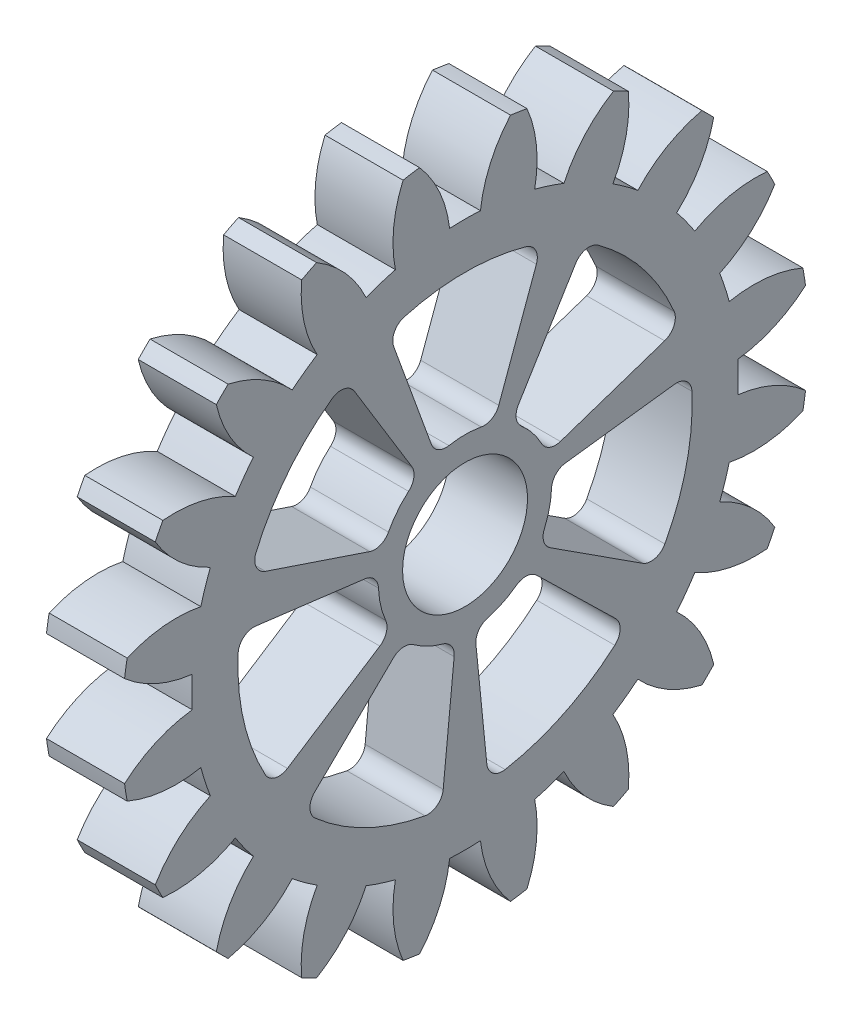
from build123d import *

# Parameters (mm, degrees)
BASPROSKE_W             = 5
BASPROSKE_H             = 22
TOOTHCUT_DEPTH          = 32.511902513
TEETHCUTS_COUNT         = 20
TEETHCUTS_ANGLE         = 342
BORSKE_R                = 4
BORE_DEPTH              = 50.0000508
ENL_V_MAT_EXTRU_1_DEPTH = 10


with BuildPart() as part:
    # BasProSke → Base-Revolve (revolve)
    with BuildSketch(Plane(origin=(0, 0, 0), x_dir=(1, 0, 0), z_dir=(0, 1, 0)), mode=Mode.PRIVATE) as base_revolve_sk:
        with Locations((2.5, 11)):
            Rectangle(BASPROSKE_W, BASPROSKE_H)
    revolve(base_revolve_sk.sketch.rotate(Axis((-10, 0, 0), (1, 0, 0)), 180), axis=Axis((-10, 0, 0), (1, 0, 0)))

    # TooCutSke → ToothCut (cut, through all)
    with BuildSketch(Plane(origin=(0, 0, 0), x_dir=(0, 0, -1), z_dir=(1, 0, 0))):
        with BuildLine():
            ThreePointArc((0.986171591, 17.471189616), (0, 17.499), (-0.986171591, 17.471189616))
            ThreePointArc((-0.986171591, 17.471189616), (-1.626916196, 19.798789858), (-2.932850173, 21.829260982))
            ThreePointArc((-2.932850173, 21.829260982), (0, 22.0254), (2.932850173, 21.829260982))
            ThreePointArc((2.932850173, 21.829260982), (1.626916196, 19.798789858), (0.986171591, 17.471189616))
        make_face()
    toothcut = extrude(amount=TOOTHCUT_DEPTH, mode=Mode.SUBTRACT)

    # TeethCuts: ToothCut ×20 about axis
    teethcuts_axis = Axis((-10, 0, 0), (1, 0, 0))
    for i in range(1, TEETHCUTS_COUNT):
        add(toothcut.rotate(teethcuts_axis, i * TEETHCUTS_ANGLE / (TEETHCUTS_COUNT - 1)), mode=Mode.SUBTRACT)

    # BorSke → Bore (cut, symmetric)
    with BuildSketch(Plane(origin=(0, 0, 0), x_dir=(0, 0, -1), z_dir=(1, 0, 0))):
        with Locations(Location((0, 0, 0), (0, 0, 180))):
            Circle(BORSKE_R)
    extrude(amount=BORE_DEPTH, both=True, mode=Mode.SUBTRACT)

    # Esquisse1 → Enl_v. mat.-Extru.1 (cut)
    with BuildSketch(Plane(origin=(5, 0, 0), x_dir=(0, 0, -1), z_dir=(1, 0, 0))):
        with BuildLine():
            Line((-4.569029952, 12.710164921), (-2.159331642, 6.089573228))
            ThreePointArc((-2.159331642, 6.089573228), (-1.714053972, 5.562367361), (-1.033326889, 5.449102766))
            ThreePointArc((-1.033326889, 5.449102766), (0, 5.546213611), (1.033326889, 5.449102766))
            ThreePointArc((1.033326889, 5.449102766), (1.714053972, 5.562367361), (2.159331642, 6.089573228))
            Line((2.159331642, 6.089573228), (4.569029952, 12.710164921))
            ThreePointArc((4.569029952, 12.710164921), (4.5185115, 13.509753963), (3.897236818, 14.015631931))
            ThreePointArc((3.897236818, 14.015631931), (0, 14.547384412), (-3.897236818, 14.015631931))
            ThreePointArc((-3.897236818, 14.015631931), (-4.5185115, 13.509753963), (-4.569029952, 12.710164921))
        make_face()
        with BuildLine():
            Line((7.088463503, 11.496869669), (3.414698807, 5.485020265))
            ThreePointArc((3.414698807, 5.485020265), (3.280138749, 4.808180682), (3.616011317, 4.205347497))
            ThreePointArc((3.616011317, 4.205347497), (4.336204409, 3.458007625), (4.904548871, 2.589572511))
            ThreePointArc((4.904548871, 2.589572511), (5.417529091, 2.127977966), (6.107341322, 2.108553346))
            Line((6.107341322, 2.108553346), (12.785950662, 4.352446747))
            ThreePointArc((12.785950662, 4.352446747), (13.379596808, 4.890479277), (13.387749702, 5.691621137))
            ThreePointArc((13.387749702, 5.691621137), (11.373603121, 9.070145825), (8.527974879, 11.785586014))
            ThreePointArc((8.527974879, 11.785586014), (7.745105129, 11.955908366), (7.088463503, 11.496869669))
        make_face()
        with BuildLine():
            Line((13.408199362, 1.626197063), (6.417391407, 0.750135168))
            ThreePointArc((6.417391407, 0.750135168), (5.804320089, 0.43333588), (5.542419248, -0.205120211))
            ThreePointArc((5.542419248, -0.205120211), (5.407158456, -1.234148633), (5.082545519, -2.219958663))
            ThreePointArc((5.082545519, -2.219958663), (5.041494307, -2.90882224), (5.45639842, -3.460250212))
            Line((5.45639842, -3.460250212), (11.374789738, -7.282752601))
            ThreePointArc((11.374789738, -7.282752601), (12.165572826, -7.411426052), (12.797014, -6.918296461))
            ThreePointArc((12.797014, -6.918296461), (14.182651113, -3.237097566), (14.531447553, 0.680753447))
            ThreePointArc((14.531447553, 0.680753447), (14.176499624, 1.399019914), (13.408199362, 1.626197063))
        make_face()
        with BuildLine():
            Line((9.631287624, -9.4690351), (4.587657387, -4.54961701))
            ThreePointArc((4.587657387, -4.54961701), (3.957730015, -4.267819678), (3.29527244, -4.461128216))
            ThreePointArc((3.29527244, -4.461128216), (2.406411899, -4.996965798), (1.433281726, -5.357815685))
            ThreePointArc((1.433281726, -5.357815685), (0.869111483, -5.75521997), (0.696676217, -6.423414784))
            Line((0.696676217, -6.423414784), (1.398180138, -13.433890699))
            ThreePointArc((1.398180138, -13.433890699), (1.790624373, -14.132376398), (2.569865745, -14.318595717))
            ThreePointArc((2.569865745, -14.318595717), (6.311873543, -13.106740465), (9.592443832, -10.936700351))
            ThreePointArc((9.592443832, -10.936700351), (9.932700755, -10.211359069), (9.631287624, -9.4690351))
        make_face()
        with BuildLine():
            Line((-1.398180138, -13.433890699), (-0.696676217, -6.423414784))
            ThreePointArc((-0.696676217, -6.423414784), (-0.869111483, -5.75521997), (-1.433281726, -5.357815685))
            ThreePointArc((-1.433281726, -5.357815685), (-2.406411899, -4.996965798), (-3.29527244, -4.461128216))
            ThreePointArc((-3.29527244, -4.461128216), (-3.957730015, -4.267819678), (-4.587657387, -4.54961701))
            Line((-4.587657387, -4.54961701), (-9.631287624, -9.4690351))
            ThreePointArc((-9.631287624, -9.4690351), (-9.932700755, -10.211359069), (-9.592443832, -10.936700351))
            ThreePointArc((-9.592443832, -10.936700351), (-6.311873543, -13.106740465), (-2.569865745, -14.318595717))
            ThreePointArc((-2.569865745, -14.318595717), (-1.790624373, -14.132376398), (-1.398180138, -13.433890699))
        make_face()
        with BuildLine():
            Line((-11.374789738, -7.282752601), (-5.45639842, -3.460250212))
            ThreePointArc((-5.45639842, -3.460250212), (-5.041494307, -2.90882224), (-5.082545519, -2.219958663))
            ThreePointArc((-5.082545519, -2.219958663), (-5.407158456, -1.234148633), (-5.542419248, -0.205120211))
            ThreePointArc((-5.542419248, -0.205120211), (-5.804320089, 0.43333588), (-6.417391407, 0.750135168))
            Line((-6.417391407, 0.750135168), (-13.408199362, 1.626197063))
            ThreePointArc((-13.408199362, 1.626197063), (-14.176499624, 1.399019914), (-14.531447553, 0.680753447))
            ThreePointArc((-14.531447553, 0.680753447), (-14.182651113, -3.237097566), (-12.797014, -6.918296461))
            ThreePointArc((-12.797014, -6.918296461), (-12.165572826, -7.411426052), (-11.374789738, -7.282752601))
        make_face()
        with BuildLine():
            Line((-12.785950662, 4.352446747), (-6.107341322, 2.108553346))
            ThreePointArc((-6.107341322, 2.108553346), (-5.417529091, 2.127977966), (-4.904548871, 2.589572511))
            ThreePointArc((-4.904548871, 2.589572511), (-4.336204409, 3.458007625), (-3.616011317, 4.205347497))
            ThreePointArc((-3.616011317, 4.205347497), (-3.280138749, 4.808180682), (-3.414698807, 5.485020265))
            Line((-3.414698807, 5.485020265), (-7.088463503, 11.496869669))
            ThreePointArc((-7.088463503, 11.496869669), (-7.745105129, 11.955908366), (-8.527974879, 11.785586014))
            ThreePointArc((-8.527974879, 11.785586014), (-11.373603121, 9.070145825), (-13.387749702, 5.691621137))
            ThreePointArc((-13.387749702, 5.691621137), (-13.379596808, 4.890479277), (-12.785950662, 4.352446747))
        make_face()
    extrude(amount=-ENL_V_MAT_EXTRU_1_DEPTH, mode=Mode.SUBTRACT)


solid = part.part
